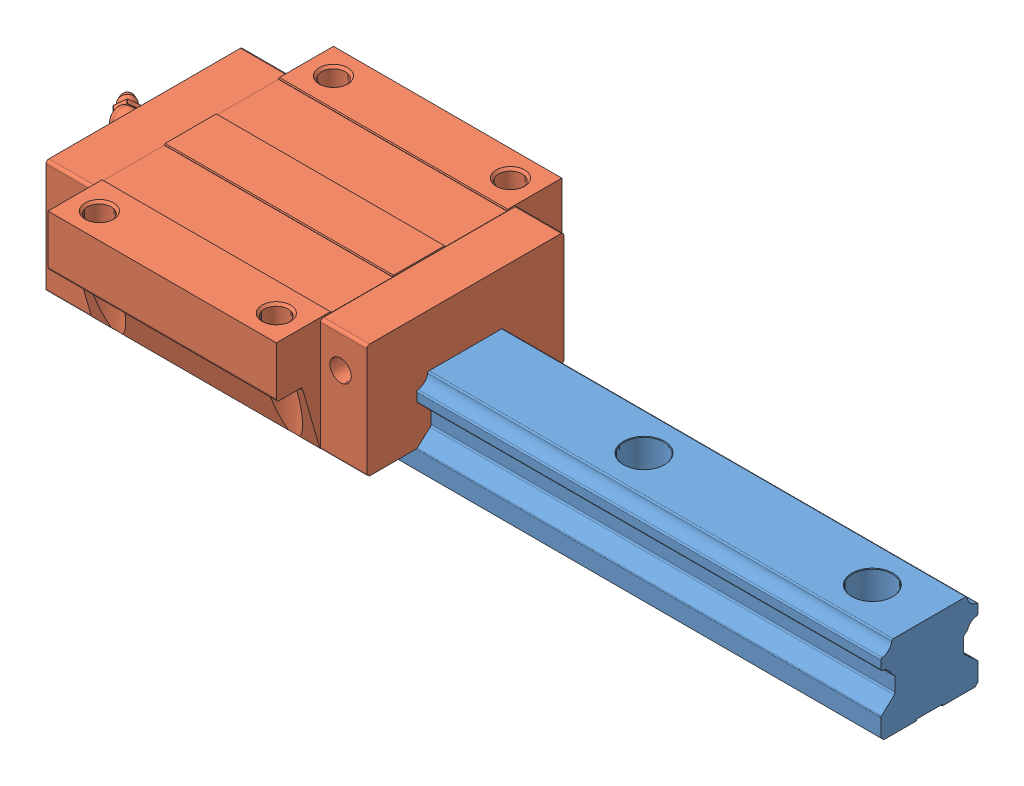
SolidWorks assembly HLW35CC.stp.sldasm, configuration 默认 (file format 13000). Lengths in mm.
Overall size (289.43 48 100).
2 component instances, 2 part files, 0 mates.
Components (placement in the parent):
- HLR35R280 E=20-1: HLR35R280 E=20.SLDPRT [默认] at origin size (280 29 34)
- HLW35CC-1: HLW35CC.SLDPRT [默认] at (5 7.5 0) size (126.83 40.5 100)
